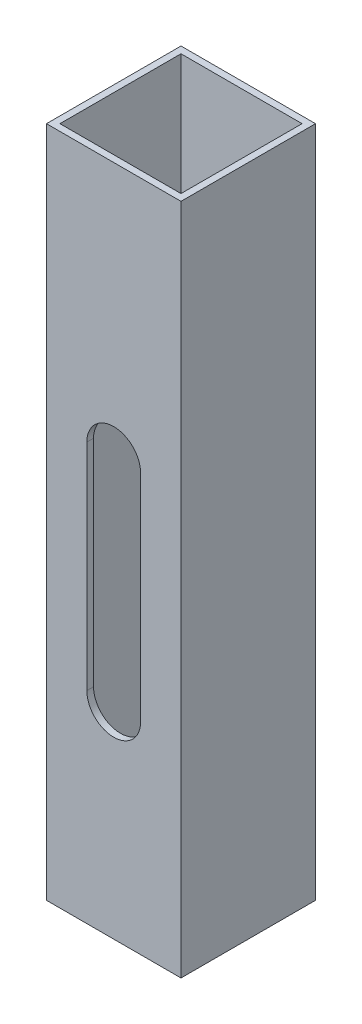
from build123d import *

# Parameters (mm, degrees)
ESQUISSE1_W            = 200
ESQUISSE1_H            = 200
FORME_EXT_RIEURE_DEPTH = 1000
TROU_T                 = -10
VIDEMENT_TRAPPE_REACH  = 1026.695


with BuildPart() as part:
    # Esquisse1 → Forme ext_rieure (new body)
    with BuildSketch(Plane(origin=(0, 0, 0), x_dir=(1, 0, 0), z_dir=(0, 1, 0))):
        Rectangle(ESQUISSE1_W, ESQUISSE1_H)
    extrude(amount=FORME_EXT_RIEURE_DEPTH)

    # Trou
    trou_openings = [part.faces().sort_by_distance(p)[0] for p in [
        (0, 1000, 0),
        (0, 0, 0),
    ]]
    offset(amount=TROU_T, openings=trou_openings, kind=Kind.INTERSECTION)

    # Esquisse2 → videment trappe (cut, up to next)
    with BuildSketch(Plane.XY.offset(100), mode=Mode.PRIVATE) as videment_trappe_sk1:
        with BuildLine():
            Line((-40, 300), (-40, 620))
            ThreePointArc((-40, 620), (0, 660), (40, 620))
            Line((40, 620), (40, 300))
            ThreePointArc((40, 300), (0, 260), (-40, 300))
        make_face()
    videment_trappe_tool1 = extrude(videment_trappe_sk1.sketch, amount=-VIDEMENT_TRAPPE_REACH, mode=Mode.PRIVATE) & part.part
    add(videment_trappe_tool1.solids().sort_by_distance((0, 460, 100))[0], mode=Mode.SUBTRACT)


solid = part.part
